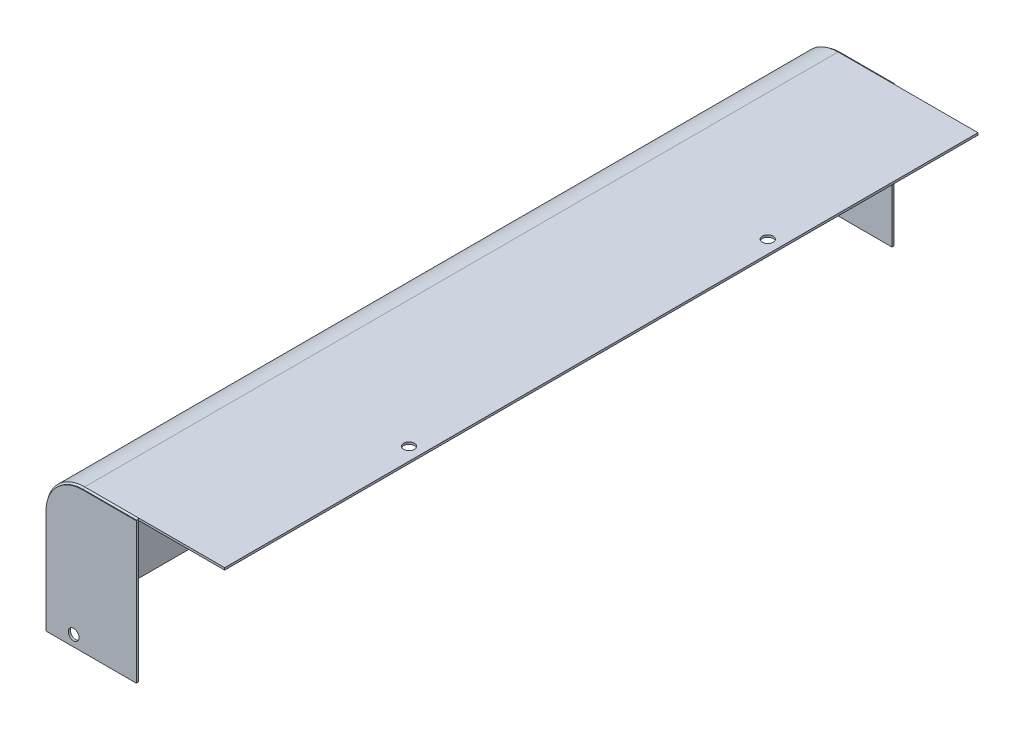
ISO-10303-21;
HEADER;
FILE_DESCRIPTION(('STEP AP214'),'2;1');
FILE_NAME('part.step','',(''),(''),'','','');
FILE_SCHEMA(('AUTOMOTIVE_DESIGN { 1 0 10303 214 1 1 1 1 }'));
ENDSEC;
DATA;
#1=APPLICATION_CONTEXT('core data for automotive mechanical design processes');
#2=APPLICATION_PROTOCOL_DEFINITION('international standard','automotive_design',2000,#1);
#3=PRODUCT_CONTEXT('',#1,'mechanical');
#4=PRODUCT('Part','Part','',(#3));
#5=PRODUCT_RELATED_PRODUCT_CATEGORY('part','',(#4));
#6=PRODUCT_DEFINITION_FORMATION('','',#4);
#7=PRODUCT_DEFINITION_CONTEXT('part definition',#1,'design');
#8=PRODUCT_DEFINITION('design','',#6,#7);
#9=PRODUCT_DEFINITION_SHAPE('','',#8);
#10=(LENGTH_UNIT() NAMED_UNIT(*) SI_UNIT(.MILLI.,.METRE.));
#11=(NAMED_UNIT(*) PLANE_ANGLE_UNIT() SI_UNIT($,.RADIAN.));
#12=(NAMED_UNIT(*) SI_UNIT($,.STERADIAN.) SOLID_ANGLE_UNIT());
#13=UNCERTAINTY_MEASURE_WITH_UNIT(LENGTH_MEASURE(1.E-05),#10,'distance_accuracy_value','');
#14=(GEOMETRIC_REPRESENTATION_CONTEXT(3) GLOBAL_UNCERTAINTY_ASSIGNED_CONTEXT((#13)) GLOBAL_UNIT_ASSIGNED_CONTEXT((#10,
#11,#12)) REPRESENTATION_CONTEXT('',''));
#15=CARTESIAN_POINT('',(0.,0.,0.));
#16=DIRECTION('',(0.,0.,1.));
#17=DIRECTION('',(1.,0.,0.));
#18=AXIS2_PLACEMENT_3D('',#15,#16,#17);
#19=CARTESIAN_POINT('',(-32.3472856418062,-130.353881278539,1050.));
#20=DIRECTION('',(0.,1.,0.));
#21=DIRECTION('',(0.,0.,1.));
#22=AXIS2_PLACEMENT_3D('',#19,#20,#21);
#23=PLANE('',#22);
#24=DIRECTION('',(1.,0.,0.));
#25=VECTOR('',#24,1.);
#26=CARTESIAN_POINT('',(20.6527143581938,-130.353881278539,1050.));
#27=LINE('',#26,#25);
#28=CARTESIAN_POINT('',(-32.3472856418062,-130.353881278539,1050.));
#29=VERTEX_POINT('',#28);
#30=CARTESIAN_POINT('',(-30.3472856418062,-130.353881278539,1050.));
#31=VERTEX_POINT('',#30);
#32=EDGE_CURVE('E124',#29,#31,#27,.T.);
#33=ORIENTED_EDGE('',*,*,#32,.T.);
#34=DIRECTION('',(0.,0.,-1.));
#35=VECTOR('',#34,1.);
#36=CARTESIAN_POINT('',(-30.3472856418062,-130.353881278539,1050.));
#37=LINE('',#36,#35);
#38=CARTESIAN_POINT('',(-30.3472856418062,-130.353881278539,1052.));
#39=VERTEX_POINT('',#38);
#40=EDGE_CURVE('E63',#39,#31,#37,.T.);
#41=ORIENTED_EDGE('',*,*,#40,.F.);
#42=DIRECTION('',(0.707106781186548,0.,0.707106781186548));
#43=VECTOR('',#42,1.);
#44=CARTESIAN_POINT('',(-32.3472856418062,-130.353881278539,1050.));
#45=LINE('',#44,#43);
#46=EDGE_CURVE('E12',#39,#29,#45,.F.);
#47=ORIENTED_EDGE('',*,*,#46,.T.);
#48=EDGE_LOOP('',(#33,#41,#47));
#49=FACE_BOUND('',#48,.T.);
#50=ADVANCED_FACE('F41',(#49),#23,.F.);
#51=CARTESIAN_POINT('',(95.6527143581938,-130.353881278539,1053.));
#52=DIRECTION('',(-1.,0.,0.));
#53=DIRECTION('',(0.,0.,1.));
#54=AXIS2_PLACEMENT_3D('',#51,#52,#53);
#55=PLANE('',#54);
#56=DIRECTION('',(0.,0.,-1.));
#57=VECTOR('',#56,1.);
#58=CARTESIAN_POINT('',(95.6527143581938,65.6461187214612,1053.));
#59=LINE('',#58,#57);
#60=CARTESIAN_POINT('',(95.6527143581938,65.6461187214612,1052.));
#61=VERTEX_POINT('',#60);
#62=CARTESIAN_POINT('',(95.6527143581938,65.6461187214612,1050.));
#63=VERTEX_POINT('',#62);
#64=EDGE_CURVE('E56',#61,#63,#59,.T.);
#65=ORIENTED_EDGE('',*,*,#64,.T.);
#66=DIRECTION('',(0.,-1.,0.));
#67=VECTOR('',#66,1.);
#68=CARTESIAN_POINT('',(95.6527143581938,-130.353881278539,1050.));
#69=LINE('',#68,#67);
#70=CARTESIAN_POINT('',(95.6527143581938,67.6461187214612,1050.));
#71=VERTEX_POINT('',#70);
#72=EDGE_CURVE('E129',#71,#63,#69,.T.);
#73=ORIENTED_EDGE('',*,*,#72,.F.);
#74=DIRECTION('',(0.,0.707106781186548,-0.707106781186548));
#75=VECTOR('',#74,1.);
#76=CARTESIAN_POINT('',(95.6527143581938,-32.8538812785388,1150.5));
#77=LINE('',#76,#75);
#78=EDGE_CURVE('E49',#71,#61,#77,.F.);
#79=ORIENTED_EDGE('',*,*,#78,.T.);
#80=EDGE_LOOP('',(#65,#73,#79));
#81=FACE_BOUND('',#80,.T.);
#82=ADVANCED_FACE('F43',(#81),#55,.F.);
#83=CARTESIAN_POINT('',(-30.3472856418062,14.6461187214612,1052.));
#84=DIRECTION('',(-0.707106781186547,0.,0.707106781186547));
#85=DIRECTION('',(0.707106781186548,0.,0.707106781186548));
#86=AXIS2_PLACEMENT_3D('',#83,#84,#85);
#87=PLANE('',#86);
#88=ORIENTED_EDGE('',*,*,#46,.F.);
#89=DIRECTION('',(0.,-1.,0.));
#90=VECTOR('',#89,1.);
#91=CARTESIAN_POINT('',(-30.3472856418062,-130.353881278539,1052.));
#92=LINE('',#91,#90);
#93=CARTESIAN_POINT('',(-30.3472856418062,14.6461187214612,1052.));
#94=VERTEX_POINT('',#93);
#95=EDGE_CURVE('E143',#94,#39,#92,.T.);
#96=ORIENTED_EDGE('',*,*,#95,.F.);
#97=DIRECTION('',(0.707106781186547,0.,0.707106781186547));
#98=VECTOR('',#97,1.);
#99=CARTESIAN_POINT('',(-32.3472856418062,14.6461187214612,1050.));
#100=LINE('',#99,#98);
#101=CARTESIAN_POINT('',(-32.3472856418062,14.6461187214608,1050.));
#102=VERTEX_POINT('',#101);
#103=EDGE_CURVE('E134',#102,#94,#100,.T.);
#104=ORIENTED_EDGE('',*,*,#103,.F.);
#105=DIRECTION('',(0.,-1.,0.));
#106=VECTOR('',#105,1.);
#107=CARTESIAN_POINT('',(-32.3472856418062,14.6461187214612,1050.));
#108=LINE('',#107,#106);
#109=EDGE_CURVE('E115',#102,#29,#108,.T.);
#110=ORIENTED_EDGE('',*,*,#109,.T.);
#111=EDGE_LOOP('',(#88,#96,#104,#110));
#112=FACE_BOUND('',#111,.T.);
#113=ADVANCED_FACE('F165',(#112),#87,.T.);
#114=CARTESIAN_POINT('',(20.6527143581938,14.6461187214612,1052.));
#115=DIRECTION('',(0.,0.,-1.));
#116=DIRECTION('',(-1.,0.,0.));
#117=AXIS2_PLACEMENT_3D('',#114,#115,#116);
#118=CONICAL_SURFACE('',#117,51.,0.785398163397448);
#119=ORIENTED_EDGE('',*,*,#103,.T.);
#120=CARTESIAN_POINT('',(20.6527143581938,14.6461187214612,1052.));
#121=DIRECTION('',(0.,0.,-1.));
#122=DIRECTION('',(-1.,0.,0.));
#123=AXIS2_PLACEMENT_3D('',#120,#121,#122);
#124=CIRCLE('',#123,51.);
#125=CARTESIAN_POINT('',(20.6527143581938,65.6461187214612,1052.));
#126=VERTEX_POINT('',#125);
#127=EDGE_CURVE('E103',#126,#94,#124,.F.);
#128=ORIENTED_EDGE('',*,*,#127,.F.);
#129=DIRECTION('',(0.,-0.707106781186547,0.707106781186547));
#130=VECTOR('',#129,1.);
#131=CARTESIAN_POINT('',(20.6527143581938,67.6461187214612,1050.));
#132=LINE('',#131,#130);
#133=CARTESIAN_POINT('',(20.6527143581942,67.6461187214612,1050.));
#134=VERTEX_POINT('',#133);
#135=EDGE_CURVE('E131',#134,#126,#132,.T.);
#136=ORIENTED_EDGE('',*,*,#135,.F.);
#137=CARTESIAN_POINT('',(20.6527143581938,14.6461187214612,1050.));
#138=DIRECTION('',(0.,0.,-1.));
#139=DIRECTION('',(-1.,0.,0.));
#140=AXIS2_PLACEMENT_3D('',#137,#138,#139);
#141=CIRCLE('',#140,53.);
#142=EDGE_CURVE('E119',#134,#102,#141,.F.);
#143=ORIENTED_EDGE('',*,*,#142,.T.);
#144=EDGE_LOOP('',(#119,#128,#136,#143));
#145=FACE_BOUND('',#144,.T.);
#146=ADVANCED_FACE('F169',(#145),#118,.T.);
#147=CARTESIAN_POINT('',(95.6527143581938,65.6461187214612,1052.));
#148=DIRECTION('',(0.,0.707106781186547,0.707106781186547));
#149=DIRECTION('',(0.,-0.707106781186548,0.707106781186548));
#150=AXIS2_PLACEMENT_3D('',#147,#148,#149);
#151=PLANE('',#150);
#152=ORIENTED_EDGE('',*,*,#78,.F.);
#153=DIRECTION('',(-1.,0.,0.));
#154=VECTOR('',#153,1.);
#155=CARTESIAN_POINT('',(20.6527143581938,67.6461187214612,1050.));
#156=LINE('',#155,#154);
#157=EDGE_CURVE('E137',#71,#134,#156,.T.);
#158=ORIENTED_EDGE('',*,*,#157,.T.);
#159=ORIENTED_EDGE('',*,*,#135,.T.);
#160=DIRECTION('',(-1.,0.,0.));
#161=VECTOR('',#160,1.);
#162=CARTESIAN_POINT('',(20.6527143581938,65.6461187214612,1052.));
#163=LINE('',#162,#161);
#164=EDGE_CURVE('E140',#61,#126,#163,.T.);
#165=ORIENTED_EDGE('',*,*,#164,.F.);
#166=EDGE_LOOP('',(#152,#158,#159,#165));
#167=FACE_BOUND('',#166,.T.);
#168=ADVANCED_FACE('F149',(#167),#151,.T.);
#169=CARTESIAN_POINT('',(-30.3472856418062,14.6461187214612,1053.));
#170=DIRECTION('',(1.,0.,0.));
#171=DIRECTION('',(0.,1.,0.));
#172=AXIS2_PLACEMENT_3D('',#169,#170,#171);
#173=PLANE('',#172);
#174=ORIENTED_EDGE('',*,*,#95,.T.);
#175=ORIENTED_EDGE('',*,*,#40,.T.);
#176=DIRECTION('',(0.,-1.,0.));
#177=VECTOR('',#176,1.);
#178=CARTESIAN_POINT('',(-30.3472856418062,14.6461187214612,1050.));
#179=LINE('',#178,#177);
#180=CARTESIAN_POINT('',(-30.3472856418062,14.6461187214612,1050.));
#181=VERTEX_POINT('',#180);
#182=EDGE_CURVE('E109',#181,#31,#179,.T.);
#183=ORIENTED_EDGE('',*,*,#182,.F.);
#184=DIRECTION('',(0.,0.,1.));
#185=VECTOR('',#184,1.);
#186=CARTESIAN_POINT('',(-30.3472856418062,14.6461187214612,1053.));
#187=LINE('',#186,#185);
#188=EDGE_CURVE('E95',#94,#181,#187,.F.);
#189=ORIENTED_EDGE('',*,*,#188,.F.);
#190=EDGE_LOOP('',(#174,#175,#183,#189));
#191=FACE_BOUND('',#190,.T.);
#192=ADVANCED_FACE('F110',(#191),#173,.T.);
#193=CARTESIAN_POINT('',(20.6527143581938,14.6461187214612,1050.));
#194=DIRECTION('',(0.,0.,-1.));
#195=DIRECTION('',(-1.,0.,0.));
#196=AXIS2_PLACEMENT_3D('',#193,#194,#195);
#197=PLANE('',#196);
#198=ORIENTED_EDGE('',*,*,#72,.T.);
#199=DIRECTION('',(-1.,0.,0.));
#200=VECTOR('',#199,1.);
#201=CARTESIAN_POINT('',(20.6527143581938,65.6461187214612,1050.));
#202=LINE('',#201,#200);
#203=CARTESIAN_POINT('',(20.6527143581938,65.6461187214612,1050.));
#204=VERTEX_POINT('',#203);
#205=EDGE_CURVE('E112',#63,#204,#202,.T.);
#206=ORIENTED_EDGE('',*,*,#205,.T.);
#207=CARTESIAN_POINT('',(20.6527143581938,14.6461187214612,1050.));
#208=DIRECTION('',(0.,0.,-1.));
#209=DIRECTION('',(-1.,0.,0.));
#210=AXIS2_PLACEMENT_3D('',#207,#208,#209);
#211=CIRCLE('',#210,51.);
#212=EDGE_CURVE('E100',#204,#181,#211,.F.);
#213=ORIENTED_EDGE('',*,*,#212,.T.);
#214=ORIENTED_EDGE('',*,*,#182,.T.);
#215=ORIENTED_EDGE('',*,*,#32,.F.);
#216=ORIENTED_EDGE('',*,*,#109,.F.);
#217=ORIENTED_EDGE('',*,*,#142,.F.);
#218=ORIENTED_EDGE('',*,*,#157,.F.);
#219=EDGE_LOOP('',(#198,#206,#213,#214,#215,#216,#217,#218));
#220=FACE_BOUND('',#219,.T.);
#221=ADVANCED_FACE('F114',(#220),#197,.T.);
#222=CARTESIAN_POINT('',(95.6527143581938,65.6461187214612,1053.));
#223=DIRECTION('',(0.,-1.,0.));
#224=DIRECTION('',(0.,0.,-1.));
#225=AXIS2_PLACEMENT_3D('',#222,#223,#224);
#226=PLANE('',#225);
#227=ORIENTED_EDGE('',*,*,#164,.T.);
#228=DIRECTION('',(0.,0.,-1.));
#229=VECTOR('',#228,1.);
#230=CARTESIAN_POINT('',(20.6527143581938,65.6461187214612,1053.));
#231=LINE('',#230,#229);
#232=EDGE_CURVE('E106',#126,#204,#231,.T.);
#233=ORIENTED_EDGE('',*,*,#232,.T.);
#234=ORIENTED_EDGE('',*,*,#205,.F.);
#235=ORIENTED_EDGE('',*,*,#64,.F.);
#236=EDGE_LOOP('',(#227,#233,#234,#235));
#237=FACE_BOUND('',#236,.T.);
#238=ADVANCED_FACE('F151',(#237),#226,.T.);
#239=CARTESIAN_POINT('',(20.6527143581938,14.6461187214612,1053.));
#240=DIRECTION('',(0.,0.,-1.));
#241=DIRECTION('',(-1.,0.,0.));
#242=AXIS2_PLACEMENT_3D('',#239,#240,#241);
#243=CYLINDRICAL_SURFACE('',#242,51.);
#244=ORIENTED_EDGE('',*,*,#127,.T.);
#245=ORIENTED_EDGE('',*,*,#188,.T.);
#246=ORIENTED_EDGE('',*,*,#212,.F.);
#247=ORIENTED_EDGE('',*,*,#232,.F.);
#248=EDGE_LOOP('',(#244,#245,#246,#247));
#249=FACE_BOUND('',#248,.T.);
#250=ADVANCED_FACE('F97',(#249),#243,.F.);
#251=CLOSED_SHELL('',(#50,#82,#113,#146,#168,#192,#221,#238,#250));
#252=MANIFOLD_SOLID_BREP('B2',#251);
#253=CARTESIAN_POINT('',(95.6527143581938,-130.353881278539,-3.));
#254=DIRECTION('',(-1.,0.,0.));
#255=DIRECTION('',(0.,0.,1.));
#256=AXIS2_PLACEMENT_3D('',#253,#254,#255);
#257=PLANE('',#256);
#258=DIRECTION('',(0.,0.,1.));
#259=VECTOR('',#258,1.);
#260=CARTESIAN_POINT('',(95.6527143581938,65.6461187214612,-3.));
#261=LINE('',#260,#259);
#262=CARTESIAN_POINT('',(95.6527143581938,65.6461187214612,-2.));
#263=VERTEX_POINT('',#262);
#264=CARTESIAN_POINT('',(95.6527143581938,65.6461187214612,0.));
#265=VERTEX_POINT('',#264);
#266=EDGE_CURVE('E292',#263,#265,#261,.T.);
#267=ORIENTED_EDGE('',*,*,#266,.F.);
#268=DIRECTION('',(0.,0.707106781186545,0.70710678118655));
#269=VECTOR('',#268,1.);
#270=CARTESIAN_POINT('',(95.6527143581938,-32.8538812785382,-100.5));
#271=LINE('',#270,#269);
#272=CARTESIAN_POINT('',(95.6527143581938,67.6461187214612,0.));
#273=VERTEX_POINT('',#272);
#274=EDGE_CURVE('E39',#263,#273,#271,.T.);
#275=ORIENTED_EDGE('',*,*,#274,.T.);
#276=DIRECTION('',(0.,-1.,0.));
#277=VECTOR('',#276,1.);
#278=CARTESIAN_POINT('',(95.6527143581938,-130.353881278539,0.));
#279=LINE('',#278,#277);
#280=EDGE_CURVE('E304',#273,#265,#279,.T.);
#281=ORIENTED_EDGE('',*,*,#280,.T.);
#282=EDGE_LOOP('',(#267,#275,#281));
#283=FACE_BOUND('',#282,.T.);
#284=ADVANCED_FACE('F240',(#283),#257,.F.);
#285=CARTESIAN_POINT('',(-32.3472856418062,-130.353881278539,1050.));
#286=DIRECTION('',(0.,1.,0.));
#287=DIRECTION('',(0.,0.,1.));
#288=AXIS2_PLACEMENT_3D('',#285,#286,#287);
#289=PLANE('',#288);
#290=DIRECTION('',(0.,0.,1.));
#291=VECTOR('',#290,1.);
#292=CARTESIAN_POINT('',(-30.3472856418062,-130.353881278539,-3.));
#293=LINE('',#292,#291);
#294=CARTESIAN_POINT('',(-30.3472856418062,-130.353881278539,-2.));
#295=VERTEX_POINT('',#294);
#296=CARTESIAN_POINT('',(-30.3472856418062,-130.353881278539,0.));
#297=VERTEX_POINT('',#296);
#298=EDGE_CURVE('E254',#295,#297,#293,.T.);
#299=ORIENTED_EDGE('',*,*,#298,.T.);
#300=DIRECTION('',(1.,0.,0.));
#301=VECTOR('',#300,1.);
#302=CARTESIAN_POINT('',(20.6527143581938,-130.353881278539,0.));
#303=LINE('',#302,#301);
#304=CARTESIAN_POINT('',(-32.3472856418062,-130.353881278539,0.));
#305=VERTEX_POINT('',#304);
#306=EDGE_CURVE('E334',#305,#297,#303,.T.);
#307=ORIENTED_EDGE('',*,*,#306,.F.);
#308=DIRECTION('',(0.707106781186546,0.,-0.707106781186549));
#309=VECTOR('',#308,1.);
#310=CARTESIAN_POINT('',(-557.347285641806,-130.353881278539,525.000000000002));
#311=LINE('',#310,#309);
#312=EDGE_CURVE('E247',#305,#295,#311,.T.);
#313=ORIENTED_EDGE('',*,*,#312,.T.);
#314=EDGE_LOOP('',(#299,#307,#313));
#315=FACE_BOUND('',#314,.T.);
#316=ADVANCED_FACE('F333',(#315),#289,.F.);
#317=CARTESIAN_POINT('',(20.6527143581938,67.6461187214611,0.));
#318=DIRECTION('',(0.,-0.70710678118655,0.707106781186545));
#319=DIRECTION('',(0.,-0.707106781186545,-0.70710678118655));
#320=AXIS2_PLACEMENT_3D('',#317,#318,#319);
#321=PLANE('',#320);
#322=ORIENTED_EDGE('',*,*,#274,.F.);
#323=DIRECTION('',(1.,0.,0.));
#324=VECTOR('',#323,1.);
#325=CARTESIAN_POINT('',(95.6527143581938,65.6461187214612,-2.));
#326=LINE('',#325,#324);
#327=CARTESIAN_POINT('',(20.6527143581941,65.6461187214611,-2.));
#328=VERTEX_POINT('',#327);
#329=EDGE_CURVE('E262',#328,#263,#326,.T.);
#330=ORIENTED_EDGE('',*,*,#329,.F.);
#331=DIRECTION('',(0.,-0.707106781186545,-0.70710678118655));
#332=VECTOR('',#331,1.);
#333=CARTESIAN_POINT('',(20.6527143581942,67.6461187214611,0.));
#334=LINE('',#333,#332);
#335=CARTESIAN_POINT('',(20.6527143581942,67.6461187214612,0.));
#336=VERTEX_POINT('',#335);
#337=EDGE_CURVE('E315',#336,#328,#334,.T.);
#338=ORIENTED_EDGE('',*,*,#337,.F.);
#339=DIRECTION('',(-1.,0.,0.));
#340=VECTOR('',#339,1.);
#341=CARTESIAN_POINT('',(20.6527143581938,67.6461187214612,0.));
#342=LINE('',#341,#340);
#343=EDGE_CURVE('E323',#273,#336,#342,.T.);
#344=ORIENTED_EDGE('',*,*,#343,.F.);
#345=EDGE_LOOP('',(#322,#330,#338,#344));
#346=FACE_BOUND('',#345,.T.);
#347=ADVANCED_FACE('F351',(#346),#321,.F.);
#348=CARTESIAN_POINT('',(20.6527143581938,14.6461187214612,0.));
#349=DIRECTION('',(0.,0.,1.));
#350=DIRECTION('',(1.,0.,0.));
#351=AXIS2_PLACEMENT_3D('',#348,#349,#350);
#352=CONICAL_SURFACE('',#351,53.,0.785398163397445);
#353=ORIENTED_EDGE('',*,*,#337,.T.);
#354=CARTESIAN_POINT('',(20.6527143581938,14.6461187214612,-2.));
#355=DIRECTION('',(0.,0.,-1.));
#356=DIRECTION('',(-1.,0.,0.));
#357=AXIS2_PLACEMENT_3D('',#354,#355,#356);
#358=CIRCLE('',#357,51.);
#359=CARTESIAN_POINT('',(-30.3472856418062,14.6461187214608,-2.));
#360=VERTEX_POINT('',#359);
#361=EDGE_CURVE('E327',#360,#328,#358,.T.);
#362=ORIENTED_EDGE('',*,*,#361,.F.);
#363=DIRECTION('',(0.707106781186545,0.,-0.70710678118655));
#364=VECTOR('',#363,1.);
#365=CARTESIAN_POINT('',(-32.3472856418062,14.6461187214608,0.));
#366=LINE('',#365,#364);
#367=CARTESIAN_POINT('',(-32.3472856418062,14.6461187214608,0.));
#368=VERTEX_POINT('',#367);
#369=EDGE_CURVE('E311',#368,#360,#366,.T.);
#370=ORIENTED_EDGE('',*,*,#369,.F.);
#371=CARTESIAN_POINT('',(20.6527143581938,14.6461187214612,0.));
#372=DIRECTION('',(0.,0.,-1.));
#373=DIRECTION('',(-1.,0.,0.));
#374=AXIS2_PLACEMENT_3D('',#371,#372,#373);
#375=CIRCLE('',#374,53.);
#376=EDGE_CURVE('E349',#336,#368,#375,.F.);
#377=ORIENTED_EDGE('',*,*,#376,.F.);
#378=EDGE_LOOP('',(#353,#362,#370,#377));
#379=FACE_BOUND('',#378,.T.);
#380=ADVANCED_FACE('F346',(#379),#352,.T.);
#381=CARTESIAN_POINT('',(-32.3472856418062,14.6461187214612,0.));
#382=DIRECTION('',(0.707106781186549,0.,0.707106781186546));
#383=DIRECTION('',(0.707106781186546,0.,-0.707106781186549));
#384=AXIS2_PLACEMENT_3D('',#381,#382,#383);
#385=PLANE('',#384);
#386=ORIENTED_EDGE('',*,*,#369,.T.);
#387=DIRECTION('',(0.,1.,0.));
#388=VECTOR('',#387,1.);
#389=CARTESIAN_POINT('',(-30.3472856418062,-130.353881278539,-2.));
#390=LINE('',#389,#388);
#391=EDGE_CURVE('E325',#295,#360,#390,.T.);
#392=ORIENTED_EDGE('',*,*,#391,.F.);
#393=ORIENTED_EDGE('',*,*,#312,.F.);
#394=DIRECTION('',(0.,-1.,0.));
#395=VECTOR('',#394,1.);
#396=CARTESIAN_POINT('',(-32.3472856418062,14.6461187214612,0.));
#397=LINE('',#396,#395);
#398=EDGE_CURVE('E308',#368,#305,#397,.T.);
#399=ORIENTED_EDGE('',*,*,#398,.F.);
#400=EDGE_LOOP('',(#386,#392,#393,#399));
#401=FACE_BOUND('',#400,.T.);
#402=ADVANCED_FACE('F337',(#401),#385,.F.);
#403=CARTESIAN_POINT('',(95.6527143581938,65.6461187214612,-3.));
#404=DIRECTION('',(0.,-1.,0.));
#405=DIRECTION('',(1.,0.,0.));
#406=AXIS2_PLACEMENT_3D('',#403,#404,#405);
#407=PLANE('',#406);
#408=ORIENTED_EDGE('',*,*,#329,.T.);
#409=ORIENTED_EDGE('',*,*,#266,.T.);
#410=DIRECTION('',(-1.,0.,0.));
#411=VECTOR('',#410,1.);
#412=CARTESIAN_POINT('',(20.6527143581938,65.6461187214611,0.));
#413=LINE('',#412,#411);
#414=CARTESIAN_POINT('',(20.6527143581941,65.6461187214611,0.));
#415=VERTEX_POINT('',#414);
#416=EDGE_CURVE('E295',#265,#415,#413,.T.);
#417=ORIENTED_EDGE('',*,*,#416,.T.);
#418=DIRECTION('',(0.,0.,1.));
#419=VECTOR('',#418,1.);
#420=CARTESIAN_POINT('',(20.6527143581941,65.6461187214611,-3.));
#421=LINE('',#420,#419);
#422=EDGE_CURVE('E299',#328,#415,#421,.T.);
#423=ORIENTED_EDGE('',*,*,#422,.F.);
#424=EDGE_LOOP('',(#408,#409,#417,#423));
#425=FACE_BOUND('',#424,.T.);
#426=ADVANCED_FACE('F294',(#425),#407,.T.);
#427=CARTESIAN_POINT('',(20.6527143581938,14.6461187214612,0.));
#428=DIRECTION('',(0.,0.,-1.));
#429=DIRECTION('',(-1.,0.,0.));
#430=AXIS2_PLACEMENT_3D('',#427,#428,#429);
#431=PLANE('',#430);
#432=ORIENTED_EDGE('',*,*,#343,.T.);
#433=ORIENTED_EDGE('',*,*,#376,.T.);
#434=ORIENTED_EDGE('',*,*,#398,.T.);
#435=ORIENTED_EDGE('',*,*,#306,.T.);
#436=DIRECTION('',(0.,-1.,0.));
#437=VECTOR('',#436,1.);
#438=CARTESIAN_POINT('',(-30.3472856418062,14.6461187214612,0.));
#439=LINE('',#438,#437);
#440=CARTESIAN_POINT('',(-30.3472856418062,14.6461187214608,0.));
#441=VERTEX_POINT('',#440);
#442=EDGE_CURVE('E312',#441,#297,#439,.T.);
#443=ORIENTED_EDGE('',*,*,#442,.F.);
#444=CARTESIAN_POINT('',(20.6527143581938,14.6461187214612,0.));
#445=DIRECTION('',(0.,0.,-1.));
#446=DIRECTION('',(-1.,0.,0.));
#447=AXIS2_PLACEMENT_3D('',#444,#445,#446);
#448=CIRCLE('',#447,51.);
#449=EDGE_CURVE('E307',#415,#441,#448,.F.);
#450=ORIENTED_EDGE('',*,*,#449,.F.);
#451=ORIENTED_EDGE('',*,*,#416,.F.);
#452=ORIENTED_EDGE('',*,*,#280,.F.);
#453=EDGE_LOOP('',(#432,#433,#434,#435,#443,#450,#451,#452));
#454=FACE_BOUND('',#453,.T.);
#455=ADVANCED_FACE('F303',(#454),#431,.F.);
#456=CARTESIAN_POINT('',(-30.3472856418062,-130.353881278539,-3.));
#457=DIRECTION('',(1.,0.,0.));
#458=DIRECTION('',(0.,0.,-1.));
#459=AXIS2_PLACEMENT_3D('',#456,#457,#458);
#460=PLANE('',#459);
#461=ORIENTED_EDGE('',*,*,#391,.T.);
#462=DIRECTION('',(0.,0.,1.));
#463=VECTOR('',#462,1.);
#464=CARTESIAN_POINT('',(-30.3472856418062,14.6461187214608,-3.));
#465=LINE('',#464,#463);
#466=EDGE_CURVE('E341',#360,#441,#465,.T.);
#467=ORIENTED_EDGE('',*,*,#466,.T.);
#468=ORIENTED_EDGE('',*,*,#442,.T.);
#469=ORIENTED_EDGE('',*,*,#298,.F.);
#470=EDGE_LOOP('',(#461,#467,#468,#469));
#471=FACE_BOUND('',#470,.T.);
#472=ADVANCED_FACE('F340',(#471),#460,.T.);
#473=CARTESIAN_POINT('',(20.6527143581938,14.6461187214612,-3.));
#474=DIRECTION('',(0.,0.,1.));
#475=DIRECTION('',(1.,0.,0.));
#476=AXIS2_PLACEMENT_3D('',#473,#474,#475);
#477=CYLINDRICAL_SURFACE('',#476,51.);
#478=ORIENTED_EDGE('',*,*,#361,.T.);
#479=ORIENTED_EDGE('',*,*,#422,.T.);
#480=ORIENTED_EDGE('',*,*,#449,.T.);
#481=ORIENTED_EDGE('',*,*,#466,.F.);
#482=EDGE_LOOP('',(#478,#479,#480,#481));
#483=FACE_BOUND('',#482,.T.);
#484=ADVANCED_FACE('F344',(#483),#477,.F.);
#485=CLOSED_SHELL('',(#284,#316,#347,#380,#402,#426,#455,#472,#484));
#486=MANIFOLD_SOLID_BREP('B6',#485);
#487=CARTESIAN_POINT('',(95.6527143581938,-130.353881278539,-3.));
#488=DIRECTION('',(-1.,0.,0.));
#489=DIRECTION('',(0.,0.,1.));
#490=AXIS2_PLACEMENT_3D('',#487,#488,#489);
#491=PLANE('',#490);
#492=DIRECTION('',(0.,-1.,0.));
#493=VECTOR('',#492,1.);
#494=CARTESIAN_POINT('',(95.6527143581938,-130.353881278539,0.));
#495=LINE('',#494,#493);
#496=CARTESIAN_POINT('',(95.6527143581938,65.6461187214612,0.));
#497=VERTEX_POINT('',#496);
#498=CARTESIAN_POINT('',(95.6527143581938,-130.353881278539,0.));
#499=VERTEX_POINT('',#498);
#500=EDGE_CURVE('E490',#497,#499,#495,.T.);
#501=ORIENTED_EDGE('',*,*,#500,.T.);
#502=DIRECTION('',(0.,0.,1.));
#503=VECTOR('',#502,1.);
#504=CARTESIAN_POINT('',(95.6527143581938,-130.353881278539,-3.));
#505=LINE('',#504,#503);
#506=CARTESIAN_POINT('',(95.6527143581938,-130.353881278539,-3.));
#507=VERTEX_POINT('',#506);
#508=EDGE_CURVE('E238',#507,#499,#505,.T.);
#509=ORIENTED_EDGE('',*,*,#508,.F.);
#510=DIRECTION('',(0.,-1.,0.));
#511=VECTOR('',#510,1.);
#512=CARTESIAN_POINT('',(95.6527143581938,-130.353881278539,-3.));
#513=LINE('',#512,#511);
#514=CARTESIAN_POINT('',(95.6527143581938,65.6461187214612,-3.));
#515=VERTEX_POINT('',#514);
#516=EDGE_CURVE('E514',#515,#507,#513,.T.);
#517=ORIENTED_EDGE('',*,*,#516,.F.);
#518=DIRECTION('',(0.,0.,1.));
#519=VECTOR('',#518,1.);
#520=CARTESIAN_POINT('',(95.6527143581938,65.6461187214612,-3.));
#521=LINE('',#520,#519);
#522=EDGE_CURVE('E503',#515,#497,#521,.T.);
#523=ORIENTED_EDGE('',*,*,#522,.T.);
#524=EDGE_LOOP('',(#501,#509,#517,#523));
#525=FACE_BOUND('',#524,.T.);
#526=ADVANCED_FACE('F439',(#525),#491,.F.);
#527=CARTESIAN_POINT('',(95.6527143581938,-130.353881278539,-3.));
#528=DIRECTION('',(0.,1.,0.));
#529=DIRECTION('',(-1.,0.,0.));
#530=AXIS2_PLACEMENT_3D('',#527,#528,#529);
#531=PLANE('',#530);
#532=DIRECTION('',(-1.,0.,0.));
#533=VECTOR('',#532,1.);
#534=CARTESIAN_POINT('',(95.6527143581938,-130.353881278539,0.));
#535=LINE('',#534,#533);
#536=CARTESIAN_POINT('',(-30.3472856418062,-130.353881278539,0.));
#537=VERTEX_POINT('',#536);
#538=EDGE_CURVE('E486',#499,#537,#535,.T.);
#539=ORIENTED_EDGE('',*,*,#538,.T.);
#540=DIRECTION('',(0.,0.,1.));
#541=VECTOR('',#540,1.);
#542=CARTESIAN_POINT('',(-30.3472856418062,-130.353881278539,-3.));
#543=LINE('',#542,#541);
#544=CARTESIAN_POINT('',(-30.3472856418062,-130.353881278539,-3.));
#545=VERTEX_POINT('',#544);
#546=EDGE_CURVE('E447',#545,#537,#543,.T.);
#547=ORIENTED_EDGE('',*,*,#546,.F.);
#548=DIRECTION('',(-1.,0.,0.));
#549=VECTOR('',#548,1.);
#550=CARTESIAN_POINT('',(95.6527143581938,-130.353881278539,-3.));
#551=LINE('',#550,#549);
#552=EDGE_CURVE('E499',#507,#545,#551,.T.);
#553=ORIENTED_EDGE('',*,*,#552,.F.);
#554=ORIENTED_EDGE('',*,*,#508,.T.);
#555=EDGE_LOOP('',(#539,#547,#553,#554));
#556=FACE_BOUND('',#555,.T.);
#557=ADVANCED_FACE('F498',(#556),#531,.F.);
#558=CARTESIAN_POINT('',(-30.3472856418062,-130.353881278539,-3.));
#559=DIRECTION('',(1.,0.,0.));
#560=DIRECTION('',(0.,0.,-1.));
#561=AXIS2_PLACEMENT_3D('',#558,#559,#560);
#562=PLANE('',#561);
#563=DIRECTION('',(0.,1.,0.));
#564=VECTOR('',#563,1.);
#565=CARTESIAN_POINT('',(-30.3472856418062,-130.353881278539,0.));
#566=LINE('',#565,#564);
#567=CARTESIAN_POINT('',(-30.3472856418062,14.6461187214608,0.));
#568=VERTEX_POINT('',#567);
#569=EDGE_CURVE('E492',#537,#568,#566,.T.);
#570=ORIENTED_EDGE('',*,*,#569,.T.);
#571=DIRECTION('',(0.,0.,1.));
#572=VECTOR('',#571,1.);
#573=CARTESIAN_POINT('',(-30.3472856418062,14.6461187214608,-3.));
#574=LINE('',#573,#572);
#575=CARTESIAN_POINT('',(-30.3472856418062,14.6461187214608,-3.));
#576=VERTEX_POINT('',#575);
#577=EDGE_CURVE('E525',#576,#568,#574,.T.);
#578=ORIENTED_EDGE('',*,*,#577,.F.);
#579=DIRECTION('',(0.,1.,0.));
#580=VECTOR('',#579,1.);
#581=CARTESIAN_POINT('',(-30.3472856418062,-130.353881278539,-3.));
#582=LINE('',#581,#580);
#583=EDGE_CURVE('E517',#545,#576,#582,.T.);
#584=ORIENTED_EDGE('',*,*,#583,.F.);
#585=ORIENTED_EDGE('',*,*,#546,.T.);
#586=EDGE_LOOP('',(#570,#578,#584,#585));
#587=FACE_BOUND('',#586,.T.);
#588=ADVANCED_FACE('F530',(#587),#562,.F.);
#589=CARTESIAN_POINT('',(20.6527143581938,14.6461187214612,-3.));
#590=DIRECTION('',(0.,0.,1.));
#591=DIRECTION('',(1.,0.,0.));
#592=AXIS2_PLACEMENT_3D('',#589,#590,#591);
#593=CYLINDRICAL_SURFACE('',#592,51.);
#594=CARTESIAN_POINT('',(20.6527143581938,14.6461187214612,0.));
#595=DIRECTION('',(0.,0.,-1.));
#596=DIRECTION('',(1.,0.,0.));
#597=AXIS2_PLACEMENT_3D('',#594,#595,#596);
#598=CIRCLE('',#597,51.);
#599=CARTESIAN_POINT('',(20.6527143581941,65.6461187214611,0.));
#600=VERTEX_POINT('',#599);
#601=EDGE_CURVE('E510',#568,#600,#598,.T.);
#602=ORIENTED_EDGE('',*,*,#601,.T.);
#603=DIRECTION('',(0.,0.,1.));
#604=VECTOR('',#603,1.);
#605=CARTESIAN_POINT('',(20.6527143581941,65.6461187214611,-3.));
#606=LINE('',#605,#604);
#607=CARTESIAN_POINT('',(20.6527143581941,65.6461187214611,-3.));
#608=VERTEX_POINT('',#607);
#609=EDGE_CURVE('E522',#608,#600,#606,.T.);
#610=ORIENTED_EDGE('',*,*,#609,.F.);
#611=CARTESIAN_POINT('',(20.6527143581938,14.6461187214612,-3.));
#612=DIRECTION('',(0.,0.,-1.));
#613=DIRECTION('',(1.,0.,0.));
#614=AXIS2_PLACEMENT_3D('',#611,#612,#613);
#615=CIRCLE('',#614,51.);
#616=EDGE_CURVE('E459',#576,#608,#615,.T.);
#617=ORIENTED_EDGE('',*,*,#616,.F.);
#618=ORIENTED_EDGE('',*,*,#577,.T.);
#619=EDGE_LOOP('',(#602,#610,#617,#618));
#620=FACE_BOUND('',#619,.T.);
#621=ADVANCED_FACE('F544',(#620),#593,.T.);
#622=CARTESIAN_POINT('',(95.6527143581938,65.6461187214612,-3.));
#623=DIRECTION('',(0.,-1.,0.));
#624=DIRECTION('',(1.,0.,0.));
#625=AXIS2_PLACEMENT_3D('',#622,#623,#624);
#626=PLANE('',#625);
#627=DIRECTION('',(1.,0.,0.));
#628=VECTOR('',#627,1.);
#629=CARTESIAN_POINT('',(95.6527143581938,65.6461187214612,0.));
#630=LINE('',#629,#628);
#631=EDGE_CURVE('E512',#600,#497,#630,.T.);
#632=ORIENTED_EDGE('',*,*,#631,.T.);
#633=ORIENTED_EDGE('',*,*,#522,.F.);
#634=DIRECTION('',(1.,0.,0.));
#635=VECTOR('',#634,1.);
#636=CARTESIAN_POINT('',(95.6527143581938,65.6461187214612,-3.));
#637=LINE('',#636,#635);
#638=EDGE_CURVE('E454',#608,#515,#637,.T.);
#639=ORIENTED_EDGE('',*,*,#638,.F.);
#640=ORIENTED_EDGE('',*,*,#609,.T.);
#641=EDGE_LOOP('',(#632,#633,#639,#640));
#642=FACE_BOUND('',#641,.T.);
#643=ADVANCED_FACE('F534',(#642),#626,.F.);
#644=CARTESIAN_POINT('',(20.6527143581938,14.6461187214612,-3.));
#645=DIRECTION('',(0.,0.,1.));
#646=DIRECTION('',(1.,0.,0.));
#647=AXIS2_PLACEMENT_3D('',#644,#645,#646);
#648=PLANE('',#647);
#649=CARTESIAN_POINT('',(8.15271435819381,-115.353881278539,-3.));
#650=DIRECTION('',(0.,0.,-1.));
#651=DIRECTION('',(-1.,0.,0.));
#652=AXIS2_PLACEMENT_3D('',#649,#650,#651);
#653=CIRCLE('',#652,7.50000000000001);
#654=CARTESIAN_POINT('',(0.652714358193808,-115.353881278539,-3.));
#655=VERTEX_POINT('',#654);
#656=EDGE_CURVE('E506',#655,#655,#653,.T.);
#657=ORIENTED_EDGE('',*,*,#656,.F.);
#658=EDGE_LOOP('',(#657));
#659=FACE_BOUND('',#658,.T.);
#660=ORIENTED_EDGE('',*,*,#516,.T.);
#661=ORIENTED_EDGE('',*,*,#552,.T.);
#662=ORIENTED_EDGE('',*,*,#583,.T.);
#663=ORIENTED_EDGE('',*,*,#616,.T.);
#664=ORIENTED_EDGE('',*,*,#638,.T.);
#665=EDGE_LOOP('',(#660,#661,#662,#663,#664));
#666=FACE_BOUND('',#665,.T.);
#667=ADVANCED_FACE('F532',(#659,#666),#648,.F.);
#668=CARTESIAN_POINT('',(20.6527143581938,14.6461187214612,0.));
#669=DIRECTION('',(0.,0.,1.));
#670=DIRECTION('',(1.,0.,0.));
#671=AXIS2_PLACEMENT_3D('',#668,#669,#670);
#672=PLANE('',#671);
#673=CARTESIAN_POINT('',(8.15271435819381,-115.353881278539,0.));
#674=DIRECTION('',(0.,0.,1.));
#675=DIRECTION('',(1.,0.,0.));
#676=AXIS2_PLACEMENT_3D('',#673,#674,#675);
#677=CIRCLE('',#676,7.50000000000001);
#678=CARTESIAN_POINT('',(15.6527143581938,-115.353881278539,0.));
#679=VERTEX_POINT('',#678);
#680=EDGE_CURVE('E442',#679,#679,#677,.T.);
#681=ORIENTED_EDGE('',*,*,#680,.F.);
#682=EDGE_LOOP('',(#681));
#683=FACE_BOUND('',#682,.T.);
#684=ORIENTED_EDGE('',*,*,#500,.F.);
#685=ORIENTED_EDGE('',*,*,#631,.F.);
#686=ORIENTED_EDGE('',*,*,#601,.F.);
#687=ORIENTED_EDGE('',*,*,#569,.F.);
#688=ORIENTED_EDGE('',*,*,#538,.F.);
#689=EDGE_LOOP('',(#684,#685,#686,#687,#688));
#690=FACE_BOUND('',#689,.T.);
#691=ADVANCED_FACE('F487',(#683,#690),#672,.T.);
#692=CARTESIAN_POINT('',(8.15271435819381,-115.353881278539,1053.));
#693=DIRECTION('',(0.,0.,-1.));
#694=DIRECTION('',(-1.,0.,0.));
#695=AXIS2_PLACEMENT_3D('',#692,#693,#694);
#696=CYLINDRICAL_SURFACE('',#695,7.50000000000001);
#697=ORIENTED_EDGE('',*,*,#680,.T.);
#698=EDGE_LOOP('',(#697));
#699=FACE_BOUND('',#698,.T.);
#700=ORIENTED_EDGE('',*,*,#656,.T.);
#701=EDGE_LOOP('',(#700));
#702=FACE_BOUND('',#701,.T.);
#703=ADVANCED_FACE('F541',(#699,#702),#696,.F.);
#704=CLOSED_SHELL('',(#526,#557,#588,#621,#643,#667,#691,#703));
#705=MANIFOLD_SOLID_BREP('B33',#704);
#706=CARTESIAN_POINT('',(-30.3472856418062,14.6461187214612,1053.));
#707=DIRECTION('',(1.,0.,0.));
#708=DIRECTION('',(0.,1.,0.));
#709=AXIS2_PLACEMENT_3D('',#706,#707,#708);
#710=PLANE('',#709);
#711=DIRECTION('',(0.,-1.,0.));
#712=VECTOR('',#711,1.);
#713=CARTESIAN_POINT('',(-30.3472856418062,14.6461187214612,1050.));
#714=LINE('',#713,#712);
#715=CARTESIAN_POINT('',(-30.3472856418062,14.6461187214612,1050.));
#716=VERTEX_POINT('',#715);
#717=CARTESIAN_POINT('',(-30.3472856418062,-130.353881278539,1050.));
#718=VERTEX_POINT('',#717);
#719=EDGE_CURVE('E669',#716,#718,#714,.T.);
#720=ORIENTED_EDGE('',*,*,#719,.T.);
#721=DIRECTION('',(0.,0.,-1.));
#722=VECTOR('',#721,1.);
#723=CARTESIAN_POINT('',(-30.3472856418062,-130.353881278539,1053.));
#724=LINE('',#723,#722);
#725=CARTESIAN_POINT('',(-30.3472856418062,-130.353881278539,1053.));
#726=VERTEX_POINT('',#725);
#727=EDGE_CURVE('E437',#726,#718,#724,.T.);
#728=ORIENTED_EDGE('',*,*,#727,.F.);
#729=DIRECTION('',(0.,-1.,0.));
#730=VECTOR('',#729,1.);
#731=CARTESIAN_POINT('',(-30.3472856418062,14.6461187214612,1053.));
#732=LINE('',#731,#730);
#733=CARTESIAN_POINT('',(-30.3472856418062,14.6461187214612,1053.));
#734=VERTEX_POINT('',#733);
#735=EDGE_CURVE('E693',#734,#726,#732,.T.);
#736=ORIENTED_EDGE('',*,*,#735,.F.);
#737=DIRECTION('',(0.,0.,-1.));
#738=VECTOR('',#737,1.);
#739=CARTESIAN_POINT('',(-30.3472856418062,14.6461187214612,1053.));
#740=LINE('',#739,#738);
#741=EDGE_CURVE('E682',#734,#716,#740,.T.);
#742=ORIENTED_EDGE('',*,*,#741,.T.);
#743=EDGE_LOOP('',(#720,#728,#736,#742));
#744=FACE_BOUND('',#743,.T.);
#745=ADVANCED_FACE('F618',(#744),#710,.F.);
#746=CARTESIAN_POINT('',(-30.3472856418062,-130.353881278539,1053.));
#747=DIRECTION('',(0.,1.,0.));
#748=DIRECTION('',(0.,0.,1.));
#749=AXIS2_PLACEMENT_3D('',#746,#747,#748);
#750=PLANE('',#749);
#751=DIRECTION('',(1.,0.,0.));
#752=VECTOR('',#751,1.);
#753=CARTESIAN_POINT('',(-30.3472856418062,-130.353881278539,1050.));
#754=LINE('',#753,#752);
#755=CARTESIAN_POINT('',(95.6527143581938,-130.353881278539,1050.));
#756=VERTEX_POINT('',#755);
#757=EDGE_CURVE('E665',#718,#756,#754,.T.);
#758=ORIENTED_EDGE('',*,*,#757,.T.);
#759=DIRECTION('',(0.,0.,-1.));
#760=VECTOR('',#759,1.);
#761=CARTESIAN_POINT('',(95.6527143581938,-130.353881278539,1053.));
#762=LINE('',#761,#760);
#763=CARTESIAN_POINT('',(95.6527143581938,-130.353881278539,1053.));
#764=VERTEX_POINT('',#763);
#765=EDGE_CURVE('E626',#764,#756,#762,.T.);
#766=ORIENTED_EDGE('',*,*,#765,.F.);
#767=DIRECTION('',(1.,0.,0.));
#768=VECTOR('',#767,1.);
#769=CARTESIAN_POINT('',(-30.3472856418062,-130.353881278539,1053.));
#770=LINE('',#769,#768);
#771=EDGE_CURVE('E678',#726,#764,#770,.T.);
#772=ORIENTED_EDGE('',*,*,#771,.F.);
#773=ORIENTED_EDGE('',*,*,#727,.T.);
#774=EDGE_LOOP('',(#758,#766,#772,#773));
#775=FACE_BOUND('',#774,.T.);
#776=ADVANCED_FACE('F677',(#775),#750,.F.);
#777=CARTESIAN_POINT('',(95.6527143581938,-130.353881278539,1053.));
#778=DIRECTION('',(-1.,0.,0.));
#779=DIRECTION('',(0.,0.,1.));
#780=AXIS2_PLACEMENT_3D('',#777,#778,#779);
#781=PLANE('',#780);
#782=DIRECTION('',(0.,1.,0.));
#783=VECTOR('',#782,1.);
#784=CARTESIAN_POINT('',(95.6527143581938,-130.353881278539,1050.));
#785=LINE('',#784,#783);
#786=CARTESIAN_POINT('',(95.6527143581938,65.6461187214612,1050.));
#787=VERTEX_POINT('',#786);
#788=EDGE_CURVE('E671',#756,#787,#785,.T.);
#789=ORIENTED_EDGE('',*,*,#788,.T.);
#790=DIRECTION('',(0.,0.,-1.));
#791=VECTOR('',#790,1.);
#792=CARTESIAN_POINT('',(95.6527143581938,65.6461187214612,1053.));
#793=LINE('',#792,#791);
#794=CARTESIAN_POINT('',(95.6527143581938,65.6461187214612,1053.));
#795=VERTEX_POINT('',#794);
#796=EDGE_CURVE('E704',#795,#787,#793,.T.);
#797=ORIENTED_EDGE('',*,*,#796,.F.);
#798=DIRECTION('',(0.,1.,0.));
#799=VECTOR('',#798,1.);
#800=CARTESIAN_POINT('',(95.6527143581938,-130.353881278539,1053.));
#801=LINE('',#800,#799);
#802=EDGE_CURVE('E696',#764,#795,#801,.T.);
#803=ORIENTED_EDGE('',*,*,#802,.F.);
#804=ORIENTED_EDGE('',*,*,#765,.T.);
#805=EDGE_LOOP('',(#789,#797,#803,#804));
#806=FACE_BOUND('',#805,.T.);
#807=ADVANCED_FACE('F709',(#806),#781,.F.);
#808=CARTESIAN_POINT('',(95.6527143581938,65.6461187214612,1053.));
#809=DIRECTION('',(0.,-1.,0.));
#810=DIRECTION('',(0.,0.,-1.));
#811=AXIS2_PLACEMENT_3D('',#808,#809,#810);
#812=PLANE('',#811);
#813=DIRECTION('',(-1.,0.,0.));
#814=VECTOR('',#813,1.);
#815=CARTESIAN_POINT('',(95.6527143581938,65.6461187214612,1050.));
#816=LINE('',#815,#814);
#817=CARTESIAN_POINT('',(20.6527143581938,65.6461187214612,1050.));
#818=VERTEX_POINT('',#817);
#819=EDGE_CURVE('E689',#787,#818,#816,.T.);
#820=ORIENTED_EDGE('',*,*,#819,.T.);
#821=DIRECTION('',(0.,0.,-1.));
#822=VECTOR('',#821,1.);
#823=CARTESIAN_POINT('',(20.6527143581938,65.6461187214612,1053.));
#824=LINE('',#823,#822);
#825=CARTESIAN_POINT('',(20.6527143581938,65.6461187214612,1053.));
#826=VERTEX_POINT('',#825);
#827=EDGE_CURVE('E701',#826,#818,#824,.T.);
#828=ORIENTED_EDGE('',*,*,#827,.F.);
#829=DIRECTION('',(-1.,0.,0.));
#830=VECTOR('',#829,1.);
#831=CARTESIAN_POINT('',(95.6527143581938,65.6461187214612,1053.));
#832=LINE('',#831,#830);
#833=EDGE_CURVE('E638',#795,#826,#832,.T.);
#834=ORIENTED_EDGE('',*,*,#833,.F.);
#835=ORIENTED_EDGE('',*,*,#796,.T.);
#836=EDGE_LOOP('',(#820,#828,#834,#835));
#837=FACE_BOUND('',#836,.T.);
#838=ADVANCED_FACE('F723',(#837),#812,.F.);
#839=CARTESIAN_POINT('',(20.6527143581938,14.6461187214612,1053.));
#840=DIRECTION('',(0.,0.,-1.));
#841=DIRECTION('',(-1.,0.,0.));
#842=AXIS2_PLACEMENT_3D('',#839,#840,#841);
#843=CYLINDRICAL_SURFACE('',#842,51.);
#844=CARTESIAN_POINT('',(20.6527143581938,14.6461187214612,1050.));
#845=DIRECTION('',(0.,0.,1.));
#846=DIRECTION('',(-1.,0.,0.));
#847=AXIS2_PLACEMENT_3D('',#844,#845,#846);
#848=CIRCLE('',#847,51.);
#849=EDGE_CURVE('E691',#818,#716,#848,.T.);
#850=ORIENTED_EDGE('',*,*,#849,.T.);
#851=ORIENTED_EDGE('',*,*,#741,.F.);
#852=CARTESIAN_POINT('',(20.6527143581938,14.6461187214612,1053.));
#853=DIRECTION('',(0.,0.,1.));
#854=DIRECTION('',(-1.,0.,0.));
#855=AXIS2_PLACEMENT_3D('',#852,#853,#854);
#856=CIRCLE('',#855,51.);
#857=EDGE_CURVE('E633',#826,#734,#856,.T.);
#858=ORIENTED_EDGE('',*,*,#857,.F.);
#859=ORIENTED_EDGE('',*,*,#827,.T.);
#860=EDGE_LOOP('',(#850,#851,#858,#859));
#861=FACE_BOUND('',#860,.T.);
#862=ADVANCED_FACE('F713',(#861),#843,.T.);
#863=CARTESIAN_POINT('',(20.6527143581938,14.6461187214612,1053.));
#864=DIRECTION('',(0.,0.,-1.));
#865=DIRECTION('',(-1.,0.,0.));
#866=AXIS2_PLACEMENT_3D('',#863,#864,#865);
#867=PLANE('',#866);
#868=CARTESIAN_POINT('',(8.15271435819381,-115.353881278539,1053.));
#869=DIRECTION('',(0.,0.,-1.));
#870=DIRECTION('',(-1.,0.,0.));
#871=AXIS2_PLACEMENT_3D('',#868,#869,#870);
#872=CIRCLE('',#871,7.50000000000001);
#873=CARTESIAN_POINT('',(0.652714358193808,-115.353881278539,1053.));
#874=VERTEX_POINT('',#873);
#875=EDGE_CURVE('E685',#874,#874,#872,.T.);
#876=ORIENTED_EDGE('',*,*,#875,.T.);
#877=EDGE_LOOP('',(#876));
#878=FACE_BOUND('',#877,.T.);
#879=ORIENTED_EDGE('',*,*,#735,.T.);
#880=ORIENTED_EDGE('',*,*,#771,.T.);
#881=ORIENTED_EDGE('',*,*,#802,.T.);
#882=ORIENTED_EDGE('',*,*,#833,.T.);
#883=ORIENTED_EDGE('',*,*,#857,.T.);
#884=EDGE_LOOP('',(#879,#880,#881,#882,#883));
#885=FACE_BOUND('',#884,.T.);
#886=ADVANCED_FACE('F711',(#878,#885),#867,.F.);
#887=CARTESIAN_POINT('',(20.6527143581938,14.6461187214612,1050.));
#888=DIRECTION('',(0.,0.,-1.));
#889=DIRECTION('',(-1.,0.,0.));
#890=AXIS2_PLACEMENT_3D('',#887,#888,#889);
#891=PLANE('',#890);
#892=CARTESIAN_POINT('',(8.15271435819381,-115.353881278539,1050.));
#893=DIRECTION('',(0.,0.,-1.));
#894=DIRECTION('',(-1.,0.,0.));
#895=AXIS2_PLACEMENT_3D('',#892,#893,#894);
#896=CIRCLE('',#895,7.50000000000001);
#897=CARTESIAN_POINT('',(0.652714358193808,-115.353881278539,1050.));
#898=VERTEX_POINT('',#897);
#899=EDGE_CURVE('E621',#898,#898,#896,.T.);
#900=ORIENTED_EDGE('',*,*,#899,.F.);
#901=EDGE_LOOP('',(#900));
#902=FACE_BOUND('',#901,.T.);
#903=ORIENTED_EDGE('',*,*,#719,.F.);
#904=ORIENTED_EDGE('',*,*,#849,.F.);
#905=ORIENTED_EDGE('',*,*,#819,.F.);
#906=ORIENTED_EDGE('',*,*,#788,.F.);
#907=ORIENTED_EDGE('',*,*,#757,.F.);
#908=EDGE_LOOP('',(#903,#904,#905,#906,#907));
#909=FACE_BOUND('',#908,.T.);
#910=ADVANCED_FACE('F666',(#902,#909),#891,.T.);
#911=CARTESIAN_POINT('',(8.15271435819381,-115.353881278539,1053.));
#912=DIRECTION('',(0.,0.,-1.));
#913=DIRECTION('',(-1.,0.,0.));
#914=AXIS2_PLACEMENT_3D('',#911,#912,#913);
#915=CYLINDRICAL_SURFACE('',#914,7.50000000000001);
#916=ORIENTED_EDGE('',*,*,#899,.T.);
#917=EDGE_LOOP('',(#916));
#918=FACE_BOUND('',#917,.T.);
#919=ORIENTED_EDGE('',*,*,#875,.F.);
#920=EDGE_LOOP('',(#919));
#921=FACE_BOUND('',#920,.T.);
#922=ADVANCED_FACE('F720',(#918,#921),#915,.F.);
#923=CLOSED_SHELL('',(#745,#776,#807,#838,#862,#886,#910,#922));
#924=MANIFOLD_SOLID_BREP('B232',#923);
#925=CARTESIAN_POINT('',(-32.3472856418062,-130.353881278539,1050.));
#926=DIRECTION('',(0.,1.,0.));
#927=DIRECTION('',(0.,0.,1.));
#928=AXIS2_PLACEMENT_3D('',#925,#926,#927);
#929=PLANE('',#928);
#930=DIRECTION('',(1.,0.,0.));
#931=VECTOR('',#930,1.);
#932=CARTESIAN_POINT('',(-32.3472856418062,-130.353881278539,0.));
#933=LINE('',#932,#931);
#934=CARTESIAN_POINT('',(-32.3472856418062,-130.353881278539,0.));
#935=VERTEX_POINT('',#934);
#936=CARTESIAN_POINT('',(-29.3472856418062,-130.353881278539,0.));
#937=VERTEX_POINT('',#936);
#938=EDGE_CURVE('E856',#935,#937,#933,.T.);
#939=ORIENTED_EDGE('',*,*,#938,.T.);
#940=DIRECTION('',(0.,0.,-1.));
#941=VECTOR('',#940,1.);
#942=CARTESIAN_POINT('',(-29.3472856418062,-130.353881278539,1050.));
#943=LINE('',#942,#941);
#944=CARTESIAN_POINT('',(-29.3472856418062,-130.353881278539,1050.));
#945=VERTEX_POINT('',#944);
#946=EDGE_CURVE('E616',#945,#937,#943,.T.);
#947=ORIENTED_EDGE('',*,*,#946,.F.);
#948=DIRECTION('',(1.,0.,0.));
#949=VECTOR('',#948,1.);
#950=CARTESIAN_POINT('',(-32.3472856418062,-130.353881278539,1050.));
#951=LINE('',#950,#949);
#952=CARTESIAN_POINT('',(-32.3472856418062,-130.353881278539,1050.));
#953=VERTEX_POINT('',#952);
#954=EDGE_CURVE('E888',#953,#945,#951,.T.);
#955=ORIENTED_EDGE('',*,*,#954,.F.);
#956=DIRECTION('',(0.,0.,-1.));
#957=VECTOR('',#956,1.);
#958=CARTESIAN_POINT('',(-32.3472856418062,-130.353881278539,1050.));
#959=LINE('',#958,#957);
#960=EDGE_CURVE('E869',#953,#935,#959,.T.);
#961=ORIENTED_EDGE('',*,*,#960,.T.);
#962=EDGE_LOOP('',(#939,#947,#955,#961));
#963=FACE_BOUND('',#962,.T.);
#964=ADVANCED_FACE('F788',(#963),#929,.F.);
#965=CARTESIAN_POINT('',(-29.3472856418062,-130.353881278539,1050.));
#966=DIRECTION('',(-1.,0.,0.));
#967=DIRECTION('',(0.,0.,1.));
#968=AXIS2_PLACEMENT_3D('',#965,#966,#967);
#969=PLANE('',#968);
#970=DIRECTION('',(0.,1.,0.));
#971=VECTOR('',#970,1.);
#972=CARTESIAN_POINT('',(-29.3472856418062,-130.353881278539,0.));
#973=LINE('',#972,#971);
#974=CARTESIAN_POINT('',(-29.3472856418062,14.6461187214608,0.));
#975=VERTEX_POINT('',#974);
#976=EDGE_CURVE('E852',#937,#975,#973,.T.);
#977=ORIENTED_EDGE('',*,*,#976,.T.);
#978=DIRECTION('',(0.,0.,-1.));
#979=VECTOR('',#978,1.);
#980=CARTESIAN_POINT('',(-29.3472856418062,14.6461187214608,1050.));
#981=LINE('',#980,#979);
#982=CARTESIAN_POINT('',(-29.3472856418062,14.6461187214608,1050.));
#983=VERTEX_POINT('',#982);
#984=EDGE_CURVE('E795',#983,#975,#981,.T.);
#985=ORIENTED_EDGE('',*,*,#984,.F.);
#986=DIRECTION('',(0.,1.,0.));
#987=VECTOR('',#986,1.);
#988=CARTESIAN_POINT('',(-29.3472856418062,-130.353881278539,1050.));
#989=LINE('',#988,#987);
#990=EDGE_CURVE('E865',#945,#983,#989,.T.);
#991=ORIENTED_EDGE('',*,*,#990,.F.);
#992=ORIENTED_EDGE('',*,*,#946,.T.);
#993=EDGE_LOOP('',(#977,#985,#991,#992));
#994=FACE_BOUND('',#993,.T.);
#995=ADVANCED_FACE('F864',(#994),#969,.F.);
#996=CARTESIAN_POINT('',(20.6527143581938,14.6461187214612,1050.));
#997=DIRECTION('',(0.,0.,-1.));
#998=DIRECTION('',(-1.,0.,0.));
#999=AXIS2_PLACEMENT_3D('',#996,#997,#998);
#1000=CYLINDRICAL_SURFACE('',#999,50.);
#1001=CARTESIAN_POINT('',(20.6527143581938,14.6461187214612,0.));
#1002=DIRECTION('',(0.,0.,-1.));
#1003=DIRECTION('',(-1.,0.,0.));
#1004=AXIS2_PLACEMENT_3D('',#1001,#1002,#1003);
#1005=CIRCLE('',#1004,50.);
#1006=CARTESIAN_POINT('',(20.6527143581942,64.6461187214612,0.));
#1007=VERTEX_POINT('',#1006);
#1008=EDGE_CURVE('E858',#975,#1007,#1005,.T.);
#1009=ORIENTED_EDGE('',*,*,#1008,.T.);
#1010=DIRECTION('',(0.,0.,-1.));
#1011=VECTOR('',#1010,1.);
#1012=CARTESIAN_POINT('',(20.6527143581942,64.6461187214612,1050.));
#1013=LINE('',#1012,#1011);
#1014=CARTESIAN_POINT('',(20.6527143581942,64.6461187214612,1050.));
#1015=VERTEX_POINT('',#1014);
#1016=EDGE_CURVE('E914',#1015,#1007,#1013,.T.);
#1017=ORIENTED_EDGE('',*,*,#1016,.F.);
#1018=CARTESIAN_POINT('',(20.6527143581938,14.6461187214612,1050.));
#1019=DIRECTION('',(0.,0.,-1.));
#1020=DIRECTION('',(-1.,0.,0.));
#1021=AXIS2_PLACEMENT_3D('',#1018,#1019,#1020);
#1022=CIRCLE('',#1021,50.);
#1023=EDGE_CURVE('E891',#983,#1015,#1022,.T.);
#1024=ORIENTED_EDGE('',*,*,#1023,.F.);
#1025=ORIENTED_EDGE('',*,*,#984,.T.);
#1026=EDGE_LOOP('',(#1009,#1017,#1024,#1025));
#1027=FACE_BOUND('',#1026,.T.);
#1028=ADVANCED_FACE('F918',(#1027),#1000,.F.);
#1029=CARTESIAN_POINT('',(20.6527143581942,64.6461187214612,1050.));
#1030=DIRECTION('',(0.,1.,0.));
#1031=DIRECTION('',(0.,0.,1.));
#1032=AXIS2_PLACEMENT_3D('',#1029,#1030,#1031);
#1033=PLANE('',#1032);
#1034=CARTESIAN_POINT('',(197.652714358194,64.6461187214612,775.));
#1035=DIRECTION('',(0.,1.,0.));
#1036=DIRECTION('',(0.,0.,1.));
#1037=AXIS2_PLACEMENT_3D('',#1034,#1035,#1036);
#1038=CIRCLE('',#1037,7.50000000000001);
#1039=CARTESIAN_POINT('',(197.652714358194,64.6461187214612,782.5));
#1040=VERTEX_POINT('',#1039);
#1041=EDGE_CURVE('E973',#1040,#1040,#1038,.T.);
#1042=ORIENTED_EDGE('',*,*,#1041,.T.);
#1043=EDGE_LOOP('',(#1042));
#1044=FACE_BOUND('',#1043,.T.);
#1045=CARTESIAN_POINT('',(197.652714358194,64.6461187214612,275.));
#1046=DIRECTION('',(0.,1.,0.));
#1047=DIRECTION('',(0.,0.,1.));
#1048=AXIS2_PLACEMENT_3D('',#1045,#1046,#1047);
#1049=CIRCLE('',#1048,7.50000000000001);
#1050=CARTESIAN_POINT('',(197.652714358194,64.6461187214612,282.5));
#1051=VERTEX_POINT('',#1050);
#1052=EDGE_CURVE('E870',#1051,#1051,#1049,.T.);
#1053=ORIENTED_EDGE('',*,*,#1052,.T.);
#1054=EDGE_LOOP('',(#1053));
#1055=FACE_BOUND('',#1054,.T.);
#1056=DIRECTION('',(1.,0.,0.));
#1057=VECTOR('',#1056,1.);
#1058=CARTESIAN_POINT('',(20.6527143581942,64.6461187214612,0.));
#1059=LINE('',#1058,#1057);
#1060=CARTESIAN_POINT('',(215.652714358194,64.6461187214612,0.));
#1061=VERTEX_POINT('',#1060);
#1062=EDGE_CURVE('E878',#1007,#1061,#1059,.T.);
#1063=ORIENTED_EDGE('',*,*,#1062,.T.);
#1064=DIRECTION('',(0.,0.,-1.));
#1065=VECTOR('',#1064,1.);
#1066=CARTESIAN_POINT('',(215.652714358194,64.6461187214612,1050.));
#1067=LINE('',#1066,#1065);
#1068=CARTESIAN_POINT('',(215.652714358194,64.6461187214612,1050.));
#1069=VERTEX_POINT('',#1068);
#1070=EDGE_CURVE('E911',#1069,#1061,#1067,.T.);
#1071=ORIENTED_EDGE('',*,*,#1070,.F.);
#1072=DIRECTION('',(1.,0.,0.));
#1073=VECTOR('',#1072,1.);
#1074=CARTESIAN_POINT('',(20.6527143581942,64.6461187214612,1050.));
#1075=LINE('',#1074,#1073);
#1076=EDGE_CURVE('E893',#1015,#1069,#1075,.T.);
#1077=ORIENTED_EDGE('',*,*,#1076,.F.);
#1078=ORIENTED_EDGE('',*,*,#1016,.T.);
#1079=EDGE_LOOP('',(#1063,#1071,#1077,#1078));
#1080=FACE_BOUND('',#1079,.T.);
#1081=ADVANCED_FACE('F926',(#1044,#1055,#1080),#1033,.F.);
#1082=CARTESIAN_POINT('',(215.652714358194,67.6461187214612,1050.));
#1083=DIRECTION('',(-1.,0.,0.));
#1084=DIRECTION('',(0.,-1.,0.));
#1085=AXIS2_PLACEMENT_3D('',#1082,#1083,#1084);
#1086=PLANE('',#1085);
#1087=DIRECTION('',(0.,1.,0.));
#1088=VECTOR('',#1087,1.);
#1089=CARTESIAN_POINT('',(215.652714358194,67.6461187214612,0.));
#1090=LINE('',#1089,#1088);
#1091=CARTESIAN_POINT('',(215.652714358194,67.6461187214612,0.));
#1092=VERTEX_POINT('',#1091);
#1093=EDGE_CURVE('E880',#1061,#1092,#1090,.T.);
#1094=ORIENTED_EDGE('',*,*,#1093,.T.);
#1095=DIRECTION('',(0.,0.,-1.));
#1096=VECTOR('',#1095,1.);
#1097=CARTESIAN_POINT('',(215.652714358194,67.6461187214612,1050.));
#1098=LINE('',#1097,#1096);
#1099=CARTESIAN_POINT('',(215.652714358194,67.6461187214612,1050.));
#1100=VERTEX_POINT('',#1099);
#1101=EDGE_CURVE('E908',#1100,#1092,#1098,.T.);
#1102=ORIENTED_EDGE('',*,*,#1101,.F.);
#1103=DIRECTION('',(0.,1.,0.));
#1104=VECTOR('',#1103,1.);
#1105=CARTESIAN_POINT('',(215.652714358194,67.6461187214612,1050.));
#1106=LINE('',#1105,#1104);
#1107=EDGE_CURVE('E895',#1069,#1100,#1106,.T.);
#1108=ORIENTED_EDGE('',*,*,#1107,.F.);
#1109=ORIENTED_EDGE('',*,*,#1070,.T.);
#1110=EDGE_LOOP('',(#1094,#1102,#1108,#1109));
#1111=FACE_BOUND('',#1110,.T.);
#1112=ADVANCED_FACE('F929',(#1111),#1086,.F.);
#1113=CARTESIAN_POINT('',(20.6527143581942,67.6461187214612,1050.));
#1114=DIRECTION('',(0.,-1.,0.));
#1115=DIRECTION('',(0.,0.,-1.));
#1116=AXIS2_PLACEMENT_3D('',#1113,#1114,#1115);
#1117=PLANE('',#1116);
#1118=CARTESIAN_POINT('',(197.652714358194,67.6461187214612,775.));
#1119=DIRECTION('',(0.,1.,0.));
#1120=DIRECTION('',(0.,0.,1.));
#1121=AXIS2_PLACEMENT_3D('',#1118,#1119,#1120);
#1122=CIRCLE('',#1121,7.50000000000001);
#1123=CARTESIAN_POINT('',(197.652714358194,67.6461187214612,782.5));
#1124=VERTEX_POINT('',#1123);
#1125=EDGE_CURVE('E969',#1124,#1124,#1122,.T.);
#1126=ORIENTED_EDGE('',*,*,#1125,.F.);
#1127=EDGE_LOOP('',(#1126));
#1128=FACE_BOUND('',#1127,.T.);
#1129=CARTESIAN_POINT('',(197.652714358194,67.6461187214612,275.));
#1130=DIRECTION('',(0.,1.,0.));
#1131=DIRECTION('',(0.,0.,1.));
#1132=AXIS2_PLACEMENT_3D('',#1129,#1130,#1131);
#1133=CIRCLE('',#1132,7.50000000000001);
#1134=CARTESIAN_POINT('',(197.652714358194,67.6461187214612,282.5));
#1135=VERTEX_POINT('',#1134);
#1136=EDGE_CURVE('E873',#1135,#1135,#1133,.T.);
#1137=ORIENTED_EDGE('',*,*,#1136,.F.);
#1138=EDGE_LOOP('',(#1137));
#1139=FACE_BOUND('',#1138,.T.);
#1140=DIRECTION('',(-1.,0.,0.));
#1141=VECTOR('',#1140,1.);
#1142=CARTESIAN_POINT('',(20.6527143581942,67.6461187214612,0.));
#1143=LINE('',#1142,#1141);
#1144=CARTESIAN_POINT('',(20.6527143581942,67.6461187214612,0.));
#1145=VERTEX_POINT('',#1144);
#1146=EDGE_CURVE('E882',#1092,#1145,#1143,.T.);
#1147=ORIENTED_EDGE('',*,*,#1146,.T.);
#1148=DIRECTION('',(0.,0.,-1.));
#1149=VECTOR('',#1148,1.);
#1150=CARTESIAN_POINT('',(20.6527143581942,67.6461187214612,1050.));
#1151=LINE('',#1150,#1149);
#1152=CARTESIAN_POINT('',(20.6527143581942,67.6461187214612,1050.));
#1153=VERTEX_POINT('',#1152);
#1154=EDGE_CURVE('E905',#1153,#1145,#1151,.T.);
#1155=ORIENTED_EDGE('',*,*,#1154,.F.);
#1156=DIRECTION('',(-1.,0.,0.));
#1157=VECTOR('',#1156,1.);
#1158=CARTESIAN_POINT('',(20.6527143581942,67.6461187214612,1050.));
#1159=LINE('',#1158,#1157);
#1160=EDGE_CURVE('E897',#1100,#1153,#1159,.T.);
#1161=ORIENTED_EDGE('',*,*,#1160,.F.);
#1162=ORIENTED_EDGE('',*,*,#1101,.T.);
#1163=EDGE_LOOP('',(#1147,#1155,#1161,#1162));
#1164=FACE_BOUND('',#1163,.T.);
#1165=ADVANCED_FACE('F934',(#1128,#1139,#1164),#1117,.F.);
#1166=CARTESIAN_POINT('',(20.6527143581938,14.6461187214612,1050.));
#1167=DIRECTION('',(0.,0.,-1.));
#1168=DIRECTION('',(-1.,0.,0.));
#1169=AXIS2_PLACEMENT_3D('',#1166,#1167,#1168);
#1170=CYLINDRICAL_SURFACE('',#1169,53.);
#1171=CARTESIAN_POINT('',(20.6527143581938,14.6461187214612,0.));
#1172=DIRECTION('',(0.,0.,1.));
#1173=DIRECTION('',(-1.,0.,0.));
#1174=AXIS2_PLACEMENT_3D('',#1171,#1172,#1173);
#1175=CIRCLE('',#1174,53.);
#1176=CARTESIAN_POINT('',(-32.3472856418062,14.6461187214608,0.));
#1177=VERTEX_POINT('',#1176);
#1178=EDGE_CURVE('E884',#1145,#1177,#1175,.T.);
#1179=ORIENTED_EDGE('',*,*,#1178,.T.);
#1180=DIRECTION('',(0.,0.,-1.));
#1181=VECTOR('',#1180,1.);
#1182=CARTESIAN_POINT('',(-32.3472856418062,14.6461187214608,1050.));
#1183=LINE('',#1182,#1181);
#1184=CARTESIAN_POINT('',(-32.3472856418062,14.6461187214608,1050.));
#1185=VERTEX_POINT('',#1184);
#1186=EDGE_CURVE('E902',#1185,#1177,#1183,.T.);
#1187=ORIENTED_EDGE('',*,*,#1186,.F.);
#1188=CARTESIAN_POINT('',(20.6527143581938,14.6461187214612,1050.));
#1189=DIRECTION('',(0.,0.,1.));
#1190=DIRECTION('',(-1.,0.,0.));
#1191=AXIS2_PLACEMENT_3D('',#1188,#1189,#1190);
#1192=CIRCLE('',#1191,53.);
#1193=EDGE_CURVE('E807',#1153,#1185,#1192,.T.);
#1194=ORIENTED_EDGE('',*,*,#1193,.F.);
#1195=ORIENTED_EDGE('',*,*,#1154,.T.);
#1196=EDGE_LOOP('',(#1179,#1187,#1194,#1195));
#1197=FACE_BOUND('',#1196,.T.);
#1198=ADVANCED_FACE('F937',(#1197),#1170,.T.);
#1199=CARTESIAN_POINT('',(-32.3472856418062,-130.353881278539,1050.));
#1200=DIRECTION('',(1.,0.,0.));
#1201=DIRECTION('',(0.,0.,-1.));
#1202=AXIS2_PLACEMENT_3D('',#1199,#1200,#1201);
#1203=PLANE('',#1202);
#1204=DIRECTION('',(0.,-1.,0.));
#1205=VECTOR('',#1204,1.);
#1206=CARTESIAN_POINT('',(-32.3472856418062,-130.353881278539,0.));
#1207=LINE('',#1206,#1205);
#1208=EDGE_CURVE('E886',#1177,#935,#1207,.T.);
#1209=ORIENTED_EDGE('',*,*,#1208,.T.);
#1210=ORIENTED_EDGE('',*,*,#960,.F.);
#1211=DIRECTION('',(0.,-1.,0.));
#1212=VECTOR('',#1211,1.);
#1213=CARTESIAN_POINT('',(-32.3472856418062,-130.353881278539,1050.));
#1214=LINE('',#1213,#1212);
#1215=EDGE_CURVE('E802',#1185,#953,#1214,.T.);
#1216=ORIENTED_EDGE('',*,*,#1215,.F.);
#1217=ORIENTED_EDGE('',*,*,#1186,.T.);
#1218=EDGE_LOOP('',(#1209,#1210,#1216,#1217));
#1219=FACE_BOUND('',#1218,.T.);
#1220=ADVANCED_FACE('F939',(#1219),#1203,.F.);
#1221=CARTESIAN_POINT('',(20.6527143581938,14.6461187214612,1050.));
#1222=DIRECTION('',(0.,0.,-1.));
#1223=DIRECTION('',(-1.,0.,0.));
#1224=AXIS2_PLACEMENT_3D('',#1221,#1222,#1223);
#1225=PLANE('',#1224);
#1226=ORIENTED_EDGE('',*,*,#954,.T.);
#1227=ORIENTED_EDGE('',*,*,#990,.T.);
#1228=ORIENTED_EDGE('',*,*,#1023,.T.);
#1229=ORIENTED_EDGE('',*,*,#1076,.T.);
#1230=ORIENTED_EDGE('',*,*,#1107,.T.);
#1231=ORIENTED_EDGE('',*,*,#1160,.T.);
#1232=ORIENTED_EDGE('',*,*,#1193,.T.);
#1233=ORIENTED_EDGE('',*,*,#1215,.T.);
#1234=EDGE_LOOP('',(#1226,#1227,#1228,#1229,#1230,#1231,#1232,#1233));
#1235=FACE_BOUND('',#1234,.T.);
#1236=ADVANCED_FACE('F921',(#1235),#1225,.F.);
#1237=CARTESIAN_POINT('',(20.6527143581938,14.6461187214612,0.));
#1238=DIRECTION('',(0.,0.,-1.));
#1239=DIRECTION('',(-1.,0.,0.));
#1240=AXIS2_PLACEMENT_3D('',#1237,#1238,#1239);
#1241=PLANE('',#1240);
#1242=ORIENTED_EDGE('',*,*,#938,.F.);
#1243=ORIENTED_EDGE('',*,*,#1208,.F.);
#1244=ORIENTED_EDGE('',*,*,#1178,.F.);
#1245=ORIENTED_EDGE('',*,*,#1146,.F.);
#1246=ORIENTED_EDGE('',*,*,#1093,.F.);
#1247=ORIENTED_EDGE('',*,*,#1062,.F.);
#1248=ORIENTED_EDGE('',*,*,#1008,.F.);
#1249=ORIENTED_EDGE('',*,*,#976,.F.);
#1250=EDGE_LOOP('',(#1242,#1243,#1244,#1245,#1246,#1247,#1248,#1249));
#1251=FACE_BOUND('',#1250,.T.);
#1252=ADVANCED_FACE('F853',(#1251),#1241,.T.);
#1253=CARTESIAN_POINT('',(197.652714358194,64.6461187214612,275.));
#1254=DIRECTION('',(0.,1.,0.));
#1255=DIRECTION('',(0.,0.,1.));
#1256=AXIS2_PLACEMENT_3D('',#1253,#1254,#1255);
#1257=CYLINDRICAL_SURFACE('',#1256,7.50000000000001);
#1258=ORIENTED_EDGE('',*,*,#1052,.F.);
#1259=EDGE_LOOP('',(#1258));
#1260=FACE_BOUND('',#1259,.T.);
#1261=ORIENTED_EDGE('',*,*,#1136,.T.);
#1262=EDGE_LOOP('',(#1261));
#1263=FACE_BOUND('',#1262,.T.);
#1264=ADVANCED_FACE('F980',(#1260,#1263),#1257,.F.);
#1265=CARTESIAN_POINT('',(197.652714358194,64.6461187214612,775.));
#1266=DIRECTION('',(0.,1.,0.));
#1267=DIRECTION('',(0.,0.,1.));
#1268=AXIS2_PLACEMENT_3D('',#1265,#1266,#1267);
#1269=CYLINDRICAL_SURFACE('',#1268,7.50000000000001);
#1270=ORIENTED_EDGE('',*,*,#1041,.F.);
#1271=EDGE_LOOP('',(#1270));
#1272=FACE_BOUND('',#1271,.T.);
#1273=ORIENTED_EDGE('',*,*,#1125,.T.);
#1274=EDGE_LOOP('',(#1273));
#1275=FACE_BOUND('',#1274,.T.);
#1276=ADVANCED_FACE('F978',(#1272,#1275),#1269,.F.);
#1277=CLOSED_SHELL('',(#964,#995,#1028,#1081,#1112,#1165,#1198,#1220,#1236,#1252,#1264,#1276));
#1278=MANIFOLD_SOLID_BREP('B431',#1277);
#1279=ADVANCED_BREP_SHAPE_REPRESENTATION('',(#18,#252,#486,#705,#924,#1278),#14);
#1280=SHAPE_DEFINITION_REPRESENTATION(#9,#1279);
ENDSEC;
END-ISO-10303-21;
